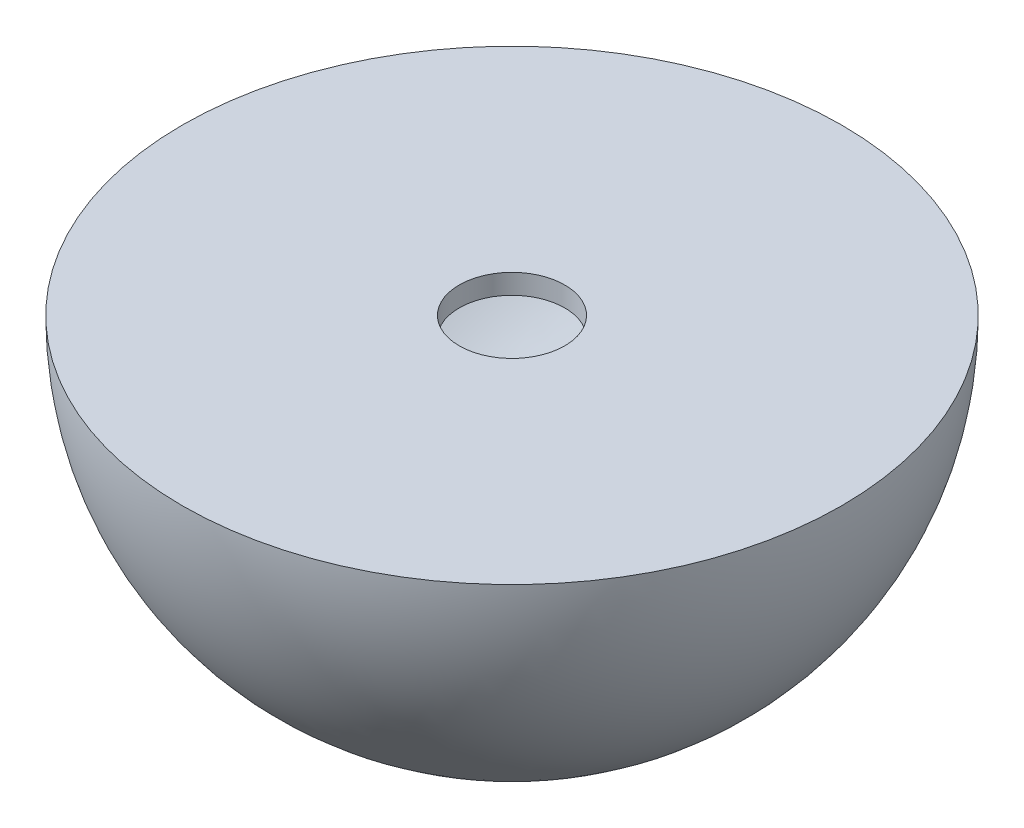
from build123d import *


with BuildPart() as part:
    # Esquisse1 → R_volution1 (revolve)
    with BuildSketch(Plane.XY):
        with BuildLine():
            Line((-6.25, 0), (-1, 0))
            Line((-1, 0), (-1, -0.377150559))
            Line((-1, -0.377150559), (-5.737617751, -0.377150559))
            ThreePointArc((-5.737617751, -0.377150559), (-3.930259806, -4.197089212), (0, -5.75))
            Line((0, -5.75), (0, -6.25))
            ThreePointArc((0, -6.25), (-4.419417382, -4.419417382), (-6.25, 0))
        make_face()
    revolve(axis=Axis((0, 39.451234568, 0), (0, -1, 0)))


solid = part.part
